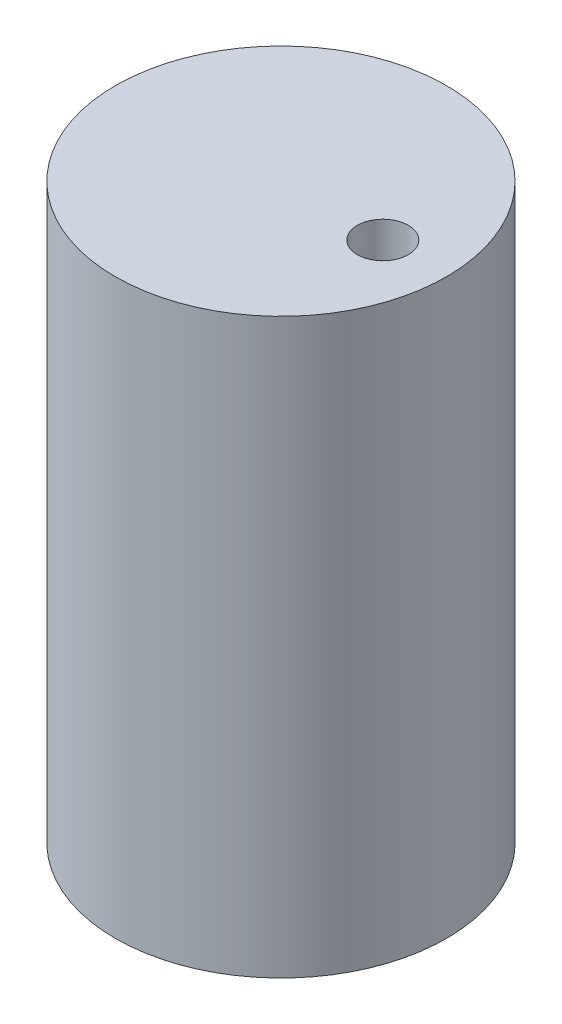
ISO-10303-21;
HEADER;
FILE_DESCRIPTION(('STEP AP214'),'2;1');
FILE_NAME('part.step','',(''),(''),'','','');
FILE_SCHEMA(('AUTOMOTIVE_DESIGN { 1 0 10303 214 1 1 1 1 }'));
ENDSEC;
DATA;
#1=APPLICATION_CONTEXT('core data for automotive mechanical design processes');
#2=APPLICATION_PROTOCOL_DEFINITION('international standard','automotive_design',2000,#1);
#3=PRODUCT_CONTEXT('',#1,'mechanical');
#4=PRODUCT('Part','Part','',(#3));
#5=PRODUCT_RELATED_PRODUCT_CATEGORY('part','',(#4));
#6=PRODUCT_DEFINITION_FORMATION('','',#4);
#7=PRODUCT_DEFINITION_CONTEXT('part definition',#1,'design');
#8=PRODUCT_DEFINITION('design','',#6,#7);
#9=PRODUCT_DEFINITION_SHAPE('','',#8);
#10=(LENGTH_UNIT() NAMED_UNIT(*) SI_UNIT(.MILLI.,.METRE.));
#11=(NAMED_UNIT(*) PLANE_ANGLE_UNIT() SI_UNIT($,.RADIAN.));
#12=(NAMED_UNIT(*) SI_UNIT($,.STERADIAN.) SOLID_ANGLE_UNIT());
#13=UNCERTAINTY_MEASURE_WITH_UNIT(LENGTH_MEASURE(1.E-05),#10,'distance_accuracy_value','');
#14=(GEOMETRIC_REPRESENTATION_CONTEXT(3) GLOBAL_UNCERTAINTY_ASSIGNED_CONTEXT((#13)) GLOBAL_UNIT_ASSIGNED_CONTEXT((#10,
#11,#12)) REPRESENTATION_CONTEXT('',''));
#15=CARTESIAN_POINT('',(0.,0.,0.));
#16=DIRECTION('',(0.,0.,1.));
#17=DIRECTION('',(1.,0.,0.));
#18=AXIS2_PLACEMENT_3D('',#15,#16,#17);
#19=CARTESIAN_POINT('',(0.,22.5,0.));
#20=DIRECTION('',(0.,1.,0.));
#21=DIRECTION('',(0.,0.,1.));
#22=AXIS2_PLACEMENT_3D('',#19,#20,#21);
#23=PLANE('',#22);
#24=CARTESIAN_POINT('',(0.,22.5,0.));
#25=DIRECTION('',(0.,1.,0.));
#26=DIRECTION('',(0.,0.,1.));
#27=AXIS2_PLACEMENT_3D('',#24,#25,#26);
#28=CIRCLE('',#27,6.5);
#29=CARTESIAN_POINT('',(0.,22.5,6.5));
#30=VERTEX_POINT('',#29);
#31=EDGE_CURVE('E9',#30,#30,#28,.T.);
#32=ORIENTED_EDGE('',*,*,#31,.T.);
#33=EDGE_LOOP('',(#32));
#34=FACE_BOUND('',#33,.T.);
#35=CARTESIAN_POINT('',(4.,22.5,0.));
#36=DIRECTION('',(0.,1.,0.));
#37=DIRECTION('',(0.,0.,1.));
#38=AXIS2_PLACEMENT_3D('',#35,#36,#37);
#39=CIRCLE('',#38,1.);
#40=CARTESIAN_POINT('',(4.,22.5,1.));
#41=VERTEX_POINT('',#40);
#42=EDGE_CURVE('E25',#41,#41,#39,.T.);
#43=ORIENTED_EDGE('',*,*,#42,.F.);
#44=EDGE_LOOP('',(#43));
#45=FACE_BOUND('',#44,.T.);
#46=ADVANCED_FACE('F14',(#34,#45),#23,.T.);
#47=CARTESIAN_POINT('',(0.,0.,0.));
#48=DIRECTION('',(0.,1.,0.));
#49=DIRECTION('',(0.,0.,1.));
#50=AXIS2_PLACEMENT_3D('',#47,#48,#49);
#51=PLANE('',#50);
#52=CARTESIAN_POINT('',(0.,0.,0.));
#53=DIRECTION('',(0.,1.,0.));
#54=DIRECTION('',(0.,0.,1.));
#55=AXIS2_PLACEMENT_3D('',#52,#53,#54);
#56=CIRCLE('',#55,6.5);
#57=CARTESIAN_POINT('',(0.,0.,6.5));
#58=VERTEX_POINT('',#57);
#59=EDGE_CURVE('E18',#58,#58,#56,.T.);
#60=ORIENTED_EDGE('',*,*,#59,.F.);
#61=EDGE_LOOP('',(#60));
#62=FACE_BOUND('',#61,.T.);
#63=CARTESIAN_POINT('',(4.,0.,0.));
#64=DIRECTION('',(0.,1.,0.));
#65=DIRECTION('',(0.,0.,1.));
#66=AXIS2_PLACEMENT_3D('',#63,#64,#65);
#67=CIRCLE('',#66,1.);
#68=CARTESIAN_POINT('',(4.,0.,1.));
#69=VERTEX_POINT('',#68);
#70=EDGE_CURVE('E27',#69,#69,#67,.T.);
#71=ORIENTED_EDGE('',*,*,#70,.T.);
#72=EDGE_LOOP('',(#71));
#73=FACE_BOUND('',#72,.T.);
#74=ADVANCED_FACE('F37',(#62,#73),#51,.F.);
#75=CARTESIAN_POINT('',(0.,22.5,0.));
#76=DIRECTION('',(0.,-1.,0.));
#77=DIRECTION('',(0.,0.,-1.));
#78=AXIS2_PLACEMENT_3D('',#75,#76,#77);
#79=CYLINDRICAL_SURFACE('',#78,6.5);
#80=ORIENTED_EDGE('',*,*,#31,.F.);
#81=EDGE_LOOP('',(#80));
#82=FACE_BOUND('',#81,.T.);
#83=ORIENTED_EDGE('',*,*,#59,.T.);
#84=EDGE_LOOP('',(#83));
#85=FACE_BOUND('',#84,.T.);
#86=ADVANCED_FACE('F16',(#82,#85),#79,.T.);
#87=CARTESIAN_POINT('',(4.,22.5,0.));
#88=DIRECTION('',(0.,-1.,0.));
#89=DIRECTION('',(0.,0.,-1.));
#90=AXIS2_PLACEMENT_3D('',#87,#88,#89);
#91=CYLINDRICAL_SURFACE('',#90,1.);
#92=ORIENTED_EDGE('',*,*,#42,.T.);
#93=EDGE_LOOP('',(#92));
#94=FACE_BOUND('',#93,.T.);
#95=ORIENTED_EDGE('',*,*,#70,.F.);
#96=EDGE_LOOP('',(#95));
#97=FACE_BOUND('',#96,.T.);
#98=ADVANCED_FACE('F33',(#94,#97),#91,.F.);
#99=CLOSED_SHELL('',(#46,#74,#86,#98));
#100=MANIFOLD_SOLID_BREP('B1',#99);
#101=ADVANCED_BREP_SHAPE_REPRESENTATION('',(#18,#100),#14);
#102=SHAPE_DEFINITION_REPRESENTATION(#9,#101);
ENDSEC;
END-ISO-10303-21;
